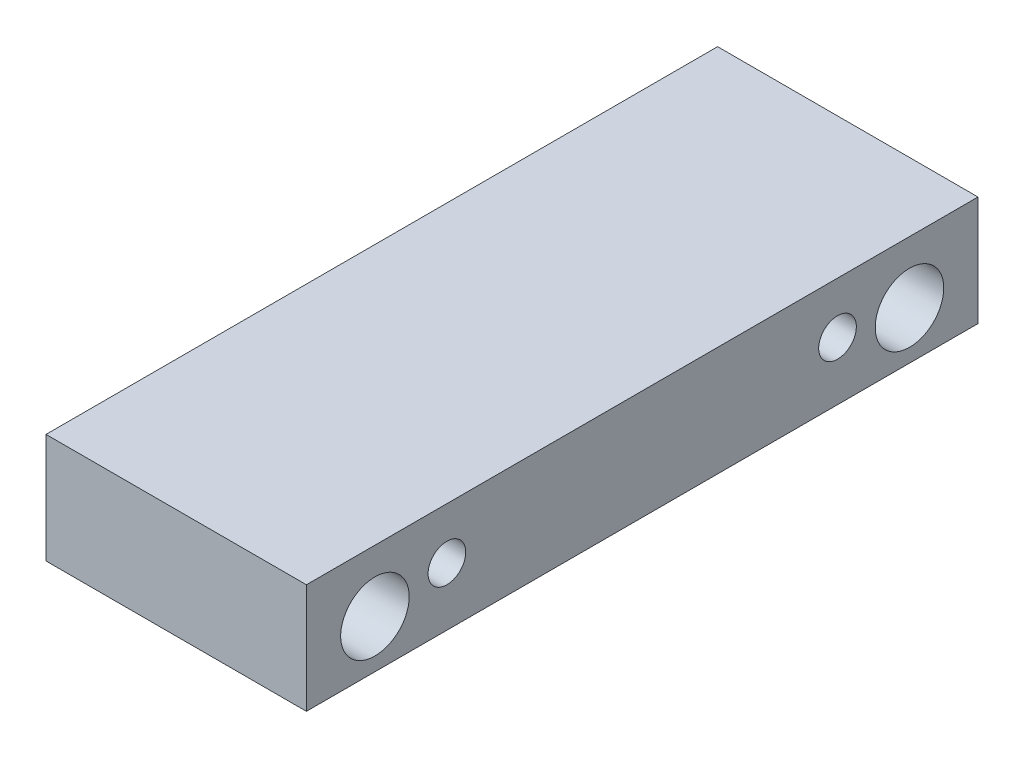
ISO-10303-21;
HEADER;
FILE_DESCRIPTION(('STEP AP214'),'2;1');
FILE_NAME('part.step','',(''),(''),'','','');
FILE_SCHEMA(('AUTOMOTIVE_DESIGN { 1 0 10303 214 1 1 1 1 }'));
ENDSEC;
DATA;
#1=APPLICATION_CONTEXT('core data for automotive mechanical design processes');
#2=APPLICATION_PROTOCOL_DEFINITION('international standard','automotive_design',2000,#1);
#3=PRODUCT_CONTEXT('',#1,'mechanical');
#4=PRODUCT('Part','Part','',(#3));
#5=PRODUCT_RELATED_PRODUCT_CATEGORY('part','',(#4));
#6=PRODUCT_DEFINITION_FORMATION('','',#4);
#7=PRODUCT_DEFINITION_CONTEXT('part definition',#1,'design');
#8=PRODUCT_DEFINITION('design','',#6,#7);
#9=PRODUCT_DEFINITION_SHAPE('','',#8);
#10=(LENGTH_UNIT() NAMED_UNIT(*) SI_UNIT(.MILLI.,.METRE.));
#11=(NAMED_UNIT(*) PLANE_ANGLE_UNIT() SI_UNIT($,.RADIAN.));
#12=(NAMED_UNIT(*) SI_UNIT($,.STERADIAN.) SOLID_ANGLE_UNIT());
#13=UNCERTAINTY_MEASURE_WITH_UNIT(LENGTH_MEASURE(1.E-05),#10,'distance_accuracy_value','');
#14=(GEOMETRIC_REPRESENTATION_CONTEXT(3) GLOBAL_UNCERTAINTY_ASSIGNED_CONTEXT((#13)) GLOBAL_UNIT_ASSIGNED_CONTEXT((#10,
#11,#12)) REPRESENTATION_CONTEXT('',''));
#15=CARTESIAN_POINT('',(0.,0.,0.));
#16=DIRECTION('',(0.,0.,1.));
#17=DIRECTION('',(1.,0.,0.));
#18=AXIS2_PLACEMENT_3D('',#15,#16,#17);
#19=CARTESIAN_POINT('',(0.,62.,0.));
#20=DIRECTION('',(1.,0.,0.));
#21=DIRECTION('',(0.,0.,-1.));
#22=AXIS2_PLACEMENT_3D('',#19,#20,#21);
#23=PLANE('',#22);
#24=DIRECTION('',(0.,0.,-1.));
#25=VECTOR('',#24,1.);
#26=CARTESIAN_POINT('',(0.,46.,0.));
#27=LINE('',#26,#25);
#28=CARTESIAN_POINT('',(0.,46.,98.));
#29=VERTEX_POINT('',#28);
#30=CARTESIAN_POINT('',(0.,45.9999999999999,-98.));
#31=VERTEX_POINT('',#30);
#32=EDGE_CURVE('E9',#29,#31,#27,.T.);
#33=ORIENTED_EDGE('',*,*,#32,.T.);
#34=DIRECTION('',(0.,-1.,0.));
#35=VECTOR('',#34,1.);
#36=CARTESIAN_POINT('',(-3.33066907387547E-13,61.9999999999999,-98.));
#37=LINE('',#36,#35);
#38=CARTESIAN_POINT('',(-3.33066907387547E-13,78.0000000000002,-98.));
#39=VERTEX_POINT('',#38);
#40=EDGE_CURVE('E70',#39,#31,#37,.T.);
#41=ORIENTED_EDGE('',*,*,#40,.F.);
#42=DIRECTION('',(0.,0.,-1.));
#43=VECTOR('',#42,1.);
#44=CARTESIAN_POINT('',(0.,78.0000000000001,0.));
#45=LINE('',#44,#43);
#46=CARTESIAN_POINT('',(5.55111512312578E-13,78.0000000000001,98.));
#47=VERTEX_POINT('',#46);
#48=EDGE_CURVE('E93',#47,#39,#45,.T.);
#49=ORIENTED_EDGE('',*,*,#48,.F.);
#50=DIRECTION('',(0.,1.,0.));
#51=VECTOR('',#50,1.);
#52=CARTESIAN_POINT('',(5.55111512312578E-13,62.,98.));
#53=LINE('',#52,#51);
#54=EDGE_CURVE('E101',#29,#47,#53,.T.);
#55=ORIENTED_EDGE('',*,*,#54,.F.);
#56=EDGE_LOOP('',(#33,#41,#49,#55));
#57=FACE_BOUND('',#56,.T.);
#58=CARTESIAN_POINT('',(0.,59.9999999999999,-78.));
#59=DIRECTION('',(-1.,0.,0.));
#60=DIRECTION('',(0.,0.,-1.));
#61=AXIS2_PLACEMENT_3D('',#58,#59,#60);
#62=CIRCLE('',#61,10.);
#63=CARTESIAN_POINT('',(0.,59.9999999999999,-88.));
#64=VERTEX_POINT('',#63);
#65=EDGE_CURVE('E24',#64,#64,#62,.T.);
#66=ORIENTED_EDGE('',*,*,#65,.T.);
#67=EDGE_LOOP('',(#66));
#68=FACE_BOUND('',#67,.T.);
#69=CARTESIAN_POINT('',(0.,60.,78.));
#70=DIRECTION('',(-1.,0.,0.));
#71=DIRECTION('',(0.,0.,-1.));
#72=AXIS2_PLACEMENT_3D('',#69,#70,#71);
#73=CIRCLE('',#72,10.);
#74=CARTESIAN_POINT('',(0.,60.,68.));
#75=VERTEX_POINT('',#74);
#76=EDGE_CURVE('E121',#75,#75,#73,.T.);
#77=ORIENTED_EDGE('',*,*,#76,.T.);
#78=EDGE_LOOP('',(#77));
#79=FACE_BOUND('',#78,.T.);
#80=CARTESIAN_POINT('',(0.,63.0000000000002,-57.));
#81=DIRECTION('',(-1.,0.,0.));
#82=DIRECTION('',(0.,0.,-1.));
#83=AXIS2_PLACEMENT_3D('',#80,#81,#82);
#84=CIRCLE('',#83,5.5);
#85=CARTESIAN_POINT('',(0.,63.0000000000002,-62.5));
#86=VERTEX_POINT('',#85);
#87=EDGE_CURVE('E124',#86,#86,#84,.T.);
#88=ORIENTED_EDGE('',*,*,#87,.T.);
#89=EDGE_LOOP('',(#88));
#90=FACE_BOUND('',#89,.T.);
#91=CARTESIAN_POINT('',(0.,63.0000000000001,57.));
#92=DIRECTION('',(-1.,0.,0.));
#93=DIRECTION('',(0.,0.,-1.));
#94=AXIS2_PLACEMENT_3D('',#91,#92,#93);
#95=CIRCLE('',#94,5.5);
#96=CARTESIAN_POINT('',(0.,63.0000000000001,51.5));
#97=VERTEX_POINT('',#96);
#98=EDGE_CURVE('E96',#97,#97,#95,.T.);
#99=ORIENTED_EDGE('',*,*,#98,.T.);
#100=EDGE_LOOP('',(#99));
#101=FACE_BOUND('',#100,.T.);
#102=ADVANCED_FACE('F14',(#57,#68,#79,#90,#101),#23,.T.);
#103=CARTESIAN_POINT('',(-37.9999999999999,78.0000000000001,0.));
#104=DIRECTION('',(0.,1.,0.));
#105=DIRECTION('',(0.,0.,1.));
#106=AXIS2_PLACEMENT_3D('',#103,#104,#105);
#107=PLANE('',#106);
#108=ORIENTED_EDGE('',*,*,#48,.T.);
#109=DIRECTION('',(1.,0.,0.));
#110=VECTOR('',#109,1.);
#111=CARTESIAN_POINT('',(-38.,78.0000000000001,-98.0000000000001));
#112=LINE('',#111,#110);
#113=CARTESIAN_POINT('',(-76.0000000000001,78.0000000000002,-98.0000000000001));
#114=VERTEX_POINT('',#113);
#115=EDGE_CURVE('E66',#114,#39,#112,.T.);
#116=ORIENTED_EDGE('',*,*,#115,.F.);
#117=DIRECTION('',(0.,0.,-1.));
#118=VECTOR('',#117,1.);
#119=CARTESIAN_POINT('',(-76.,78.0000000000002,0.));
#120=LINE('',#119,#118);
#121=CARTESIAN_POINT('',(-75.9999999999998,78.0000000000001,97.9999999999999));
#122=VERTEX_POINT('',#121);
#123=EDGE_CURVE('E63',#122,#114,#120,.T.);
#124=ORIENTED_EDGE('',*,*,#123,.F.);
#125=DIRECTION('',(-1.,0.,0.));
#126=VECTOR('',#125,1.);
#127=CARTESIAN_POINT('',(-37.9999999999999,78.0000000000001,97.9999999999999));
#128=LINE('',#127,#126);
#129=EDGE_CURVE('E98',#47,#122,#128,.T.);
#130=ORIENTED_EDGE('',*,*,#129,.F.);
#131=EDGE_LOOP('',(#108,#116,#124,#130));
#132=FACE_BOUND('',#131,.T.);
#133=ADVANCED_FACE('F143',(#132),#107,.T.);
#134=CARTESIAN_POINT('',(-76.0000000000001,62.,0.));
#135=DIRECTION('',(-1.,0.,0.));
#136=DIRECTION('',(0.,0.,1.));
#137=AXIS2_PLACEMENT_3D('',#134,#135,#136);
#138=PLANE('',#137);
#139=ORIENTED_EDGE('',*,*,#123,.T.);
#140=DIRECTION('',(0.,1.,0.));
#141=VECTOR('',#140,1.);
#142=CARTESIAN_POINT('',(-76.0000000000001,61.9999999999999,-98.));
#143=LINE('',#142,#141);
#144=CARTESIAN_POINT('',(-76.0000000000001,46.,-98.0000000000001));
#145=VERTEX_POINT('',#144);
#146=EDGE_CURVE('E58',#145,#114,#143,.T.);
#147=ORIENTED_EDGE('',*,*,#146,.F.);
#148=DIRECTION('',(0.,0.,-1.));
#149=VECTOR('',#148,1.);
#150=CARTESIAN_POINT('',(-76.0000000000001,46.,0.));
#151=LINE('',#150,#149);
#152=CARTESIAN_POINT('',(-76.,46.,97.9999999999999));
#153=VERTEX_POINT('',#152);
#154=EDGE_CURVE('E61',#153,#145,#151,.T.);
#155=ORIENTED_EDGE('',*,*,#154,.F.);
#156=DIRECTION('',(0.,-1.,0.));
#157=VECTOR('',#156,1.);
#158=CARTESIAN_POINT('',(-76.,62.,98.));
#159=LINE('',#158,#157);
#160=EDGE_CURVE('E53',#122,#153,#159,.T.);
#161=ORIENTED_EDGE('',*,*,#160,.F.);
#162=EDGE_LOOP('',(#139,#147,#155,#161));
#163=FACE_BOUND('',#162,.T.);
#164=CARTESIAN_POINT('',(-76.0000000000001,59.9999999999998,-78.));
#165=DIRECTION('',(1.,0.,0.));
#166=DIRECTION('',(0.,0.,-1.));
#167=AXIS2_PLACEMENT_3D('',#164,#165,#166);
#168=CIRCLE('',#167,10.);
#169=CARTESIAN_POINT('',(-76.0000000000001,59.9999999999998,-88.));
#170=VERTEX_POINT('',#169);
#171=EDGE_CURVE('E92',#170,#170,#168,.T.);
#172=ORIENTED_EDGE('',*,*,#171,.T.);
#173=EDGE_LOOP('',(#172));
#174=FACE_BOUND('',#173,.T.);
#175=CARTESIAN_POINT('',(-76.,60.,78.));
#176=DIRECTION('',(1.,0.,0.));
#177=DIRECTION('',(0.,0.,-1.));
#178=AXIS2_PLACEMENT_3D('',#175,#176,#177);
#179=CIRCLE('',#178,10.);
#180=CARTESIAN_POINT('',(-76.,60.,68.));
#181=VERTEX_POINT('',#180);
#182=EDGE_CURVE('E88',#181,#181,#179,.T.);
#183=ORIENTED_EDGE('',*,*,#182,.T.);
#184=EDGE_LOOP('',(#183));
#185=FACE_BOUND('',#184,.T.);
#186=CARTESIAN_POINT('',(-76.0000000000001,63.0000000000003,-56.9999999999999));
#187=DIRECTION('',(1.,0.,0.));
#188=DIRECTION('',(0.,0.,-1.));
#189=AXIS2_PLACEMENT_3D('',#186,#187,#188);
#190=CIRCLE('',#189,5.5);
#191=CARTESIAN_POINT('',(-76.0000000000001,63.0000000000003,-62.4999999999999));
#192=VERTEX_POINT('',#191);
#193=EDGE_CURVE('E83',#192,#192,#190,.T.);
#194=ORIENTED_EDGE('',*,*,#193,.T.);
#195=EDGE_LOOP('',(#194));
#196=FACE_BOUND('',#195,.T.);
#197=CARTESIAN_POINT('',(-76.0000000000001,63.0000000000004,57.0000000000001));
#198=DIRECTION('',(1.,0.,0.));
#199=DIRECTION('',(0.,0.,-1.));
#200=AXIS2_PLACEMENT_3D('',#197,#198,#199);
#201=CIRCLE('',#200,5.5);
#202=CARTESIAN_POINT('',(-76.0000000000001,63.0000000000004,51.5000000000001));
#203=VERTEX_POINT('',#202);
#204=EDGE_CURVE('E76',#203,#203,#201,.T.);
#205=ORIENTED_EDGE('',*,*,#204,.T.);
#206=EDGE_LOOP('',(#205));
#207=FACE_BOUND('',#206,.T.);
#208=ADVANCED_FACE('F59',(#163,#174,#185,#196,#207),#138,.T.);
#209=CARTESIAN_POINT('',(-37.9999999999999,46.,0.));
#210=DIRECTION('',(0.,-1.,0.));
#211=DIRECTION('',(0.,0.,-1.));
#212=AXIS2_PLACEMENT_3D('',#209,#210,#211);
#213=PLANE('',#212);
#214=ORIENTED_EDGE('',*,*,#154,.T.);
#215=DIRECTION('',(-1.,0.,0.));
#216=VECTOR('',#215,1.);
#217=CARTESIAN_POINT('',(-38.,46.,-98.));
#218=LINE('',#217,#216);
#219=EDGE_CURVE('E32',#31,#145,#218,.T.);
#220=ORIENTED_EDGE('',*,*,#219,.F.);
#221=ORIENTED_EDGE('',*,*,#32,.F.);
#222=DIRECTION('',(1.,0.,0.));
#223=VECTOR('',#222,1.);
#224=CARTESIAN_POINT('',(-37.9999999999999,46.,98.));
#225=LINE('',#224,#223);
#226=EDGE_CURVE('E74',#153,#29,#225,.T.);
#227=ORIENTED_EDGE('',*,*,#226,.F.);
#228=EDGE_LOOP('',(#214,#220,#221,#227));
#229=FACE_BOUND('',#228,.T.);
#230=ADVANCED_FACE('F73',(#229),#213,.T.);
#231=CARTESIAN_POINT('',(-38.,61.9999999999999,-98.));
#232=DIRECTION('',(0.,0.,-1.));
#233=DIRECTION('',(-1.,0.,0.));
#234=AXIS2_PLACEMENT_3D('',#231,#232,#233);
#235=PLANE('',#234);
#236=ORIENTED_EDGE('',*,*,#40,.T.);
#237=ORIENTED_EDGE('',*,*,#219,.T.);
#238=ORIENTED_EDGE('',*,*,#146,.T.);
#239=ORIENTED_EDGE('',*,*,#115,.T.);
#240=EDGE_LOOP('',(#236,#237,#238,#239));
#241=FACE_BOUND('',#240,.T.);
#242=ADVANCED_FACE('F68',(#241),#235,.T.);
#243=CARTESIAN_POINT('',(-37.9999999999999,62.,98.));
#244=DIRECTION('',(0.,0.,1.));
#245=DIRECTION('',(1.,0.,0.));
#246=AXIS2_PLACEMENT_3D('',#243,#244,#245);
#247=PLANE('',#246);
#248=ORIENTED_EDGE('',*,*,#54,.T.);
#249=ORIENTED_EDGE('',*,*,#129,.T.);
#250=ORIENTED_EDGE('',*,*,#160,.T.);
#251=ORIENTED_EDGE('',*,*,#226,.T.);
#252=EDGE_LOOP('',(#248,#249,#250,#251));
#253=FACE_BOUND('',#252,.T.);
#254=ADVANCED_FACE('F169',(#253),#247,.T.);
#255=CARTESIAN_POINT('',(-38.,59.9999999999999,-78.));
#256=DIRECTION('',(-1.,0.,0.));
#257=DIRECTION('',(0.,0.,1.));
#258=AXIS2_PLACEMENT_3D('',#255,#256,#257);
#259=CYLINDRICAL_SURFACE('',#258,10.);
#260=ORIENTED_EDGE('',*,*,#65,.F.);
#261=EDGE_LOOP('',(#260));
#262=FACE_BOUND('',#261,.T.);
#263=ORIENTED_EDGE('',*,*,#171,.F.);
#264=EDGE_LOOP('',(#263));
#265=FACE_BOUND('',#264,.T.);
#266=ADVANCED_FACE('F137',(#262,#265),#259,.F.);
#267=CARTESIAN_POINT('',(-37.9999999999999,60.,78.));
#268=DIRECTION('',(-1.,0.,0.));
#269=DIRECTION('',(0.,0.,1.));
#270=AXIS2_PLACEMENT_3D('',#267,#268,#269);
#271=CYLINDRICAL_SURFACE('',#270,10.);
#272=ORIENTED_EDGE('',*,*,#76,.F.);
#273=EDGE_LOOP('',(#272));
#274=FACE_BOUND('',#273,.T.);
#275=ORIENTED_EDGE('',*,*,#182,.F.);
#276=EDGE_LOOP('',(#275));
#277=FACE_BOUND('',#276,.T.);
#278=ADVANCED_FACE('F133',(#274,#277),#271,.F.);
#279=CARTESIAN_POINT('',(-38.,62.9999999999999,-57.0000000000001));
#280=DIRECTION('',(-1.,0.,0.));
#281=DIRECTION('',(0.,0.,1.));
#282=AXIS2_PLACEMENT_3D('',#279,#280,#281);
#283=CYLINDRICAL_SURFACE('',#282,5.5);
#284=ORIENTED_EDGE('',*,*,#87,.F.);
#285=EDGE_LOOP('',(#284));
#286=FACE_BOUND('',#285,.T.);
#287=ORIENTED_EDGE('',*,*,#193,.F.);
#288=EDGE_LOOP('',(#287));
#289=FACE_BOUND('',#288,.T.);
#290=ADVANCED_FACE('F136',(#286,#289),#283,.F.);
#291=CARTESIAN_POINT('',(-37.9999999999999,62.9999999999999,56.9999999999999));
#292=DIRECTION('',(-1.,0.,0.));
#293=DIRECTION('',(0.,0.,1.));
#294=AXIS2_PLACEMENT_3D('',#291,#292,#293);
#295=CYLINDRICAL_SURFACE('',#294,5.5);
#296=ORIENTED_EDGE('',*,*,#98,.F.);
#297=EDGE_LOOP('',(#296));
#298=FACE_BOUND('',#297,.T.);
#299=ORIENTED_EDGE('',*,*,#204,.F.);
#300=EDGE_LOOP('',(#299));
#301=FACE_BOUND('',#300,.T.);
#302=ADVANCED_FACE('F16',(#298,#301),#295,.F.);
#303=CLOSED_SHELL('',(#102,#133,#208,#230,#242,#254,#266,#278,#290,#302));
#304=MANIFOLD_SOLID_BREP('B1',#303);
#305=ADVANCED_BREP_SHAPE_REPRESENTATION('',(#18,#304),#14);
#306=SHAPE_DEFINITION_REPRESENTATION(#9,#305);
ENDSEC;
END-ISO-10303-21;
